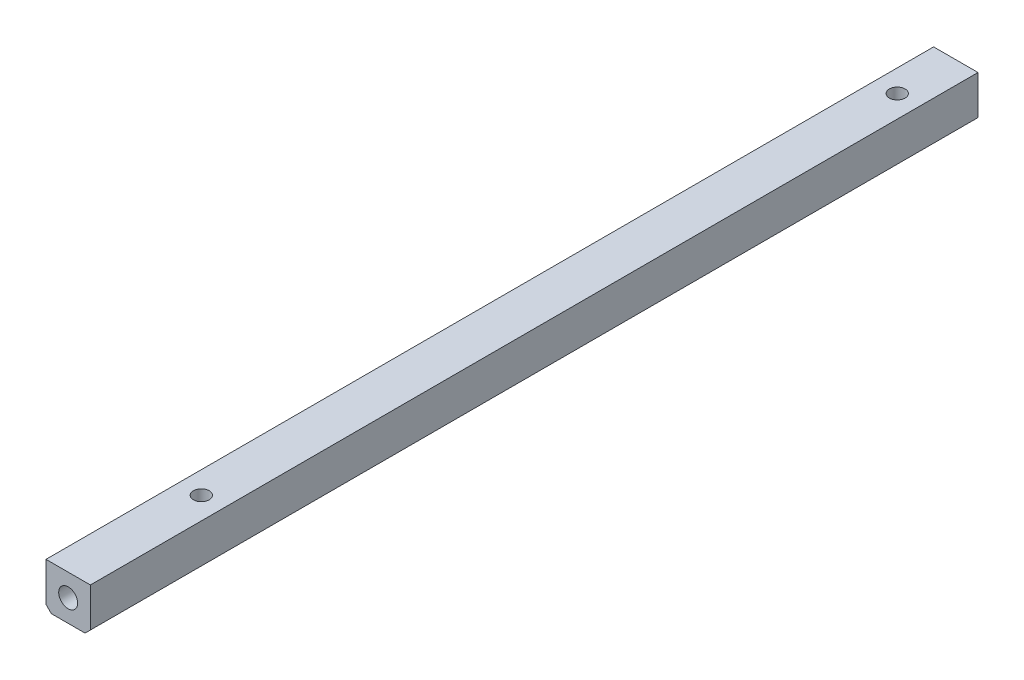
ISO-10303-21;
HEADER;
FILE_DESCRIPTION(('STEP AP214'),'2;1');
FILE_NAME('part.step','',(''),(''),'','','');
FILE_SCHEMA(('AUTOMOTIVE_DESIGN { 1 0 10303 214 1 1 1 1 }'));
ENDSEC;
DATA;
#1=APPLICATION_CONTEXT('core data for automotive mechanical design processes');
#2=APPLICATION_PROTOCOL_DEFINITION('international standard','automotive_design',2000,#1);
#3=PRODUCT_CONTEXT('',#1,'mechanical');
#4=PRODUCT('Part','Part','',(#3));
#5=PRODUCT_RELATED_PRODUCT_CATEGORY('part','',(#4));
#6=PRODUCT_DEFINITION_FORMATION('','',#4);
#7=PRODUCT_DEFINITION_CONTEXT('part definition',#1,'design');
#8=PRODUCT_DEFINITION('design','',#6,#7);
#9=PRODUCT_DEFINITION_SHAPE('','',#8);
#10=(LENGTH_UNIT() NAMED_UNIT(*) SI_UNIT(.MILLI.,.METRE.));
#11=(NAMED_UNIT(*) PLANE_ANGLE_UNIT() SI_UNIT($,.RADIAN.));
#12=(NAMED_UNIT(*) SI_UNIT($,.STERADIAN.) SOLID_ANGLE_UNIT());
#13=UNCERTAINTY_MEASURE_WITH_UNIT(LENGTH_MEASURE(1.E-05),#10,'distance_accuracy_value','');
#14=(GEOMETRIC_REPRESENTATION_CONTEXT(3) GLOBAL_UNCERTAINTY_ASSIGNED_CONTEXT((#13)) GLOBAL_UNIT_ASSIGNED_CONTEXT((#10,
#11,#12)) REPRESENTATION_CONTEXT('',''));
#15=CARTESIAN_POINT('',(0.,0.,0.));
#16=DIRECTION('',(0.,0.,1.));
#17=DIRECTION('',(1.,0.,0.));
#18=AXIS2_PLACEMENT_3D('',#15,#16,#17);
#19=CARTESIAN_POINT('',(3.17499999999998,0.,8.382));
#20=DIRECTION('',(0.,1.,0.));
#21=DIRECTION('',(-1.,0.,0.));
#22=AXIS2_PLACEMENT_3D('',#19,#20,#21);
#23=CYLINDRICAL_SURFACE('',#22,1.1303);
#24=CARTESIAN_POINT('',(3.17499999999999,6.35,8.382));
#25=DIRECTION('',(0.,1.,0.));
#26=DIRECTION('',(-1.,0.,0.));
#27=AXIS2_PLACEMENT_3D('',#24,#25,#26);
#28=CIRCLE('',#27,1.1303);
#29=CARTESIAN_POINT('',(2.04469999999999,6.35,8.382));
#30=VERTEX_POINT('',#29);
#31=EDGE_CURVE('E228',#30,#30,#28,.T.);
#32=ORIENTED_EDGE('',*,*,#31,.T.);
#33=EDGE_LOOP('',(#32));
#34=FACE_BOUND('',#33,.T.);
#35=CARTESIAN_POINT('',(3.17499999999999,3.175,8.382));
#36=DIRECTION('',(0.,0.707106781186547,0.707106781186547));
#37=DIRECTION('',(0.,0.707106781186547,-0.707106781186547));
#38=AXIS2_PLACEMENT_3D('',#35,#36,#37);
#39=ELLIPSE('',#38,1.59848558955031,1.1303);
#40=CARTESIAN_POINT('',(2.04469999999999,3.175,8.382));
#41=VERTEX_POINT('',#40);
#42=CARTESIAN_POINT('',(4.30529999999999,3.175,8.382));
#43=VERTEX_POINT('',#42);
#44=EDGE_CURVE('E100',#41,#43,#39,.F.);
#45=ORIENTED_EDGE('',*,*,#44,.T.);
#46=CARTESIAN_POINT('',(3.17499999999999,3.175,8.382));
#47=DIRECTION('',(0.,0.707106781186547,-0.707106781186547));
#48=DIRECTION('',(0.,0.707106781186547,0.707106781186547));
#49=AXIS2_PLACEMENT_3D('',#46,#47,#48);
#50=ELLIPSE('',#49,1.59848558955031,1.1303);
#51=EDGE_CURVE('E96',#43,#41,#50,.F.);
#52=ORIENTED_EDGE('',*,*,#51,.T.);
#53=EDGE_LOOP('',(#45,#52));
#54=FACE_BOUND('',#53,.T.);
#55=ADVANCED_FACE('F31',(#34,#54),#23,.F.);
#56=CARTESIAN_POINT('',(0.,0.,127.));
#57=DIRECTION('',(1.,0.,0.));
#58=DIRECTION('',(0.,0.,-1.));
#59=AXIS2_PLACEMENT_3D('',#56,#57,#58);
#60=PLANE('',#59);
#61=DIRECTION('',(0.,-1.,0.));
#62=VECTOR('',#61,1.);
#63=CARTESIAN_POINT('',(0.,0.,0.));
#64=LINE('',#63,#62);
#65=CARTESIAN_POINT('',(0.,6.35,0.));
#66=VERTEX_POINT('',#65);
#67=CARTESIAN_POINT('',(0.,0.761999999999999,0.));
#68=VERTEX_POINT('',#67);
#69=EDGE_CURVE('E150',#66,#68,#64,.T.);
#70=ORIENTED_EDGE('',*,*,#69,.T.);
#71=DIRECTION('',(0.,0.,1.));
#72=VECTOR('',#71,1.);
#73=CARTESIAN_POINT('',(0.,0.761999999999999,127.));
#74=LINE('',#73,#72);
#75=CARTESIAN_POINT('',(0.,0.761999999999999,127.));
#76=VERTEX_POINT('',#75);
#77=EDGE_CURVE('E11',#68,#76,#74,.T.);
#78=ORIENTED_EDGE('',*,*,#77,.T.);
#79=DIRECTION('',(0.,-1.,0.));
#80=VECTOR('',#79,1.);
#81=CARTESIAN_POINT('',(0.,0.,127.));
#82=LINE('',#81,#80);
#83=CARTESIAN_POINT('',(0.,6.35,127.));
#84=VERTEX_POINT('',#83);
#85=EDGE_CURVE('E159',#84,#76,#82,.T.);
#86=ORIENTED_EDGE('',*,*,#85,.F.);
#87=DIRECTION('',(0.,0.,-1.));
#88=VECTOR('',#87,1.);
#89=CARTESIAN_POINT('',(0.,6.35,127.));
#90=LINE('',#89,#88);
#91=EDGE_CURVE('E163',#84,#66,#90,.T.);
#92=ORIENTED_EDGE('',*,*,#91,.T.);
#93=EDGE_LOOP('',(#70,#78,#86,#92));
#94=FACE_BOUND('',#93,.T.);
#95=ADVANCED_FACE('F33',(#94),#60,.F.);
#96=CARTESIAN_POINT('',(0.,0.,127.));
#97=DIRECTION('',(0.,1.,0.));
#98=DIRECTION('',(0.,0.,1.));
#99=AXIS2_PLACEMENT_3D('',#96,#97,#98);
#100=PLANE('',#99);
#101=CARTESIAN_POINT('',(3.17499999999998,0.,8.382));
#102=DIRECTION('',(0.,1.,0.));
#103=DIRECTION('',(-1.,0.,0.));
#104=AXIS2_PLACEMENT_3D('',#101,#102,#103);
#105=CIRCLE('',#104,1.1303);
#106=CARTESIAN_POINT('',(2.04469999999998,0.,8.382));
#107=VERTEX_POINT('',#106);
#108=EDGE_CURVE('E221',#107,#107,#105,.T.);
#109=ORIENTED_EDGE('',*,*,#108,.T.);
#110=EDGE_LOOP('',(#109));
#111=FACE_BOUND('',#110,.T.);
#112=CARTESIAN_POINT('',(3.175,0.,107.95));
#113=DIRECTION('',(0.,1.,0.));
#114=DIRECTION('',(-1.,0.,0.));
#115=AXIS2_PLACEMENT_3D('',#112,#113,#114);
#116=CIRCLE('',#115,1.1303);
#117=CARTESIAN_POINT('',(2.0447,0.,107.95));
#118=VERTEX_POINT('',#117);
#119=EDGE_CURVE('E154',#118,#118,#116,.T.);
#120=ORIENTED_EDGE('',*,*,#119,.T.);
#121=EDGE_LOOP('',(#120));
#122=FACE_BOUND('',#121,.T.);
#123=DIRECTION('',(1.,0.,0.));
#124=VECTOR('',#123,1.);
#125=CARTESIAN_POINT('',(0.,0.,0.));
#126=LINE('',#125,#124);
#127=CARTESIAN_POINT('',(0.761999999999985,0.,0.));
#128=VERTEX_POINT('',#127);
#129=CARTESIAN_POINT('',(5.58799999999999,0.,0.));
#130=VERTEX_POINT('',#129);
#131=EDGE_CURVE('E145',#128,#130,#126,.T.);
#132=ORIENTED_EDGE('',*,*,#131,.T.);
#133=DIRECTION('',(0.,0.,1.));
#134=VECTOR('',#133,1.);
#135=CARTESIAN_POINT('',(5.58799999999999,0.,127.));
#136=LINE('',#135,#134);
#137=CARTESIAN_POINT('',(5.58799999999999,0.,127.));
#138=VERTEX_POINT('',#137);
#139=EDGE_CURVE('E52',#130,#138,#136,.T.);
#140=ORIENTED_EDGE('',*,*,#139,.T.);
#141=DIRECTION('',(1.,0.,0.));
#142=VECTOR('',#141,1.);
#143=CARTESIAN_POINT('',(0.,0.,127.));
#144=LINE('',#143,#142);
#145=CARTESIAN_POINT('',(0.761999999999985,0.,127.));
#146=VERTEX_POINT('',#145);
#147=EDGE_CURVE('E131',#146,#138,#144,.T.);
#148=ORIENTED_EDGE('',*,*,#147,.F.);
#149=DIRECTION('',(0.,0.,-1.));
#150=VECTOR('',#149,1.);
#151=CARTESIAN_POINT('',(0.761999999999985,0.,127.));
#152=LINE('',#151,#150);
#153=EDGE_CURVE('E120',#146,#128,#152,.T.);
#154=ORIENTED_EDGE('',*,*,#153,.T.);
#155=EDGE_LOOP('',(#132,#140,#148,#154));
#156=FACE_BOUND('',#155,.T.);
#157=ADVANCED_FACE('F148',(#111,#122,#156),#100,.F.);
#158=CARTESIAN_POINT('',(6.35,0.,127.));
#159=DIRECTION('',(-1.,0.,0.));
#160=DIRECTION('',(0.,0.,1.));
#161=AXIS2_PLACEMENT_3D('',#158,#159,#160);
#162=PLANE('',#161);
#163=DIRECTION('',(0.,1.,0.));
#164=VECTOR('',#163,1.);
#165=CARTESIAN_POINT('',(6.35,0.,127.));
#166=LINE('',#165,#164);
#167=CARTESIAN_POINT('',(6.35,0.762000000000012,127.));
#168=VERTEX_POINT('',#167);
#169=CARTESIAN_POINT('',(6.35,6.35,127.));
#170=VERTEX_POINT('',#169);
#171=EDGE_CURVE('E129',#168,#170,#166,.T.);
#172=ORIENTED_EDGE('',*,*,#171,.F.);
#173=DIRECTION('',(0.,0.,-1.));
#174=VECTOR('',#173,1.);
#175=CARTESIAN_POINT('',(6.35,0.762000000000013,127.));
#176=LINE('',#175,#174);
#177=CARTESIAN_POINT('',(6.35,0.762000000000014,0.));
#178=VERTEX_POINT('',#177);
#179=EDGE_CURVE('E108',#168,#178,#176,.T.);
#180=ORIENTED_EDGE('',*,*,#179,.T.);
#181=DIRECTION('',(0.,1.,0.));
#182=VECTOR('',#181,1.);
#183=CARTESIAN_POINT('',(6.35,0.,0.));
#184=LINE('',#183,#182);
#185=CARTESIAN_POINT('',(6.35,6.35,0.));
#186=VERTEX_POINT('',#185);
#187=EDGE_CURVE('E147',#178,#186,#184,.T.);
#188=ORIENTED_EDGE('',*,*,#187,.T.);
#189=DIRECTION('',(0.,0.,-1.));
#190=VECTOR('',#189,1.);
#191=CARTESIAN_POINT('',(6.35,6.35,127.));
#192=LINE('',#191,#190);
#193=EDGE_CURVE('E106',#170,#186,#192,.T.);
#194=ORIENTED_EDGE('',*,*,#193,.F.);
#195=EDGE_LOOP('',(#172,#180,#188,#194));
#196=FACE_BOUND('',#195,.T.);
#197=ADVANCED_FACE('F135',(#196),#162,.F.);
#198=CARTESIAN_POINT('',(0.,6.35,127.));
#199=DIRECTION('',(0.,-1.,0.));
#200=DIRECTION('',(1.,0.,0.));
#201=AXIS2_PLACEMENT_3D('',#198,#199,#200);
#202=PLANE('',#201);
#203=ORIENTED_EDGE('',*,*,#31,.F.);
#204=EDGE_LOOP('',(#203));
#205=FACE_BOUND('',#204,.T.);
#206=CARTESIAN_POINT('',(3.175,6.35,107.95));
#207=DIRECTION('',(0.,1.,0.));
#208=DIRECTION('',(-1.,0.,0.));
#209=AXIS2_PLACEMENT_3D('',#206,#207,#208);
#210=CIRCLE('',#209,1.1303);
#211=CARTESIAN_POINT('',(2.0447,6.35,107.95));
#212=VERTEX_POINT('',#211);
#213=EDGE_CURVE('E223',#212,#212,#210,.T.);
#214=ORIENTED_EDGE('',*,*,#213,.F.);
#215=EDGE_LOOP('',(#214));
#216=FACE_BOUND('',#215,.T.);
#217=DIRECTION('',(-1.,0.,0.));
#218=VECTOR('',#217,1.);
#219=CARTESIAN_POINT('',(0.,6.35,0.));
#220=LINE('',#219,#218);
#221=EDGE_CURVE('E152',#186,#66,#220,.T.);
#222=ORIENTED_EDGE('',*,*,#221,.T.);
#223=ORIENTED_EDGE('',*,*,#91,.F.);
#224=DIRECTION('',(-1.,0.,0.));
#225=VECTOR('',#224,1.);
#226=CARTESIAN_POINT('',(0.,6.35,127.));
#227=LINE('',#226,#225);
#228=EDGE_CURVE('E139',#170,#84,#227,.T.);
#229=ORIENTED_EDGE('',*,*,#228,.F.);
#230=ORIENTED_EDGE('',*,*,#193,.T.);
#231=EDGE_LOOP('',(#222,#223,#229,#230));
#232=FACE_BOUND('',#231,.T.);
#233=ADVANCED_FACE('F167',(#205,#216,#232),#202,.F.);
#234=CARTESIAN_POINT('',(0.,0.,127.));
#235=DIRECTION('',(0.,0.,-1.));
#236=DIRECTION('',(-1.,0.,0.));
#237=AXIS2_PLACEMENT_3D('',#234,#235,#236);
#238=PLANE('',#237);
#239=CARTESIAN_POINT('',(3.175,3.175,127.));
#240=DIRECTION('',(0.,0.,1.));
#241=DIRECTION('',(1.,0.,0.));
#242=AXIS2_PLACEMENT_3D('',#239,#240,#241);
#243=CIRCLE('',#242,1.3589);
#244=CARTESIAN_POINT('',(4.5339,3.175,127.));
#245=VERTEX_POINT('',#244);
#246=EDGE_CURVE('E233',#245,#245,#243,.T.);
#247=ORIENTED_EDGE('',*,*,#246,.F.);
#248=EDGE_LOOP('',(#247));
#249=FACE_BOUND('',#248,.T.);
#250=ORIENTED_EDGE('',*,*,#147,.T.);
#251=DIRECTION('',(-0.707106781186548,-0.707106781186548,0.));
#252=VECTOR('',#251,1.);
#253=CARTESIAN_POINT('',(6.35,0.762000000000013,127.));
#254=LINE('',#253,#252);
#255=EDGE_CURVE('E39',#138,#168,#254,.F.);
#256=ORIENTED_EDGE('',*,*,#255,.T.);
#257=ORIENTED_EDGE('',*,*,#171,.T.);
#258=ORIENTED_EDGE('',*,*,#228,.T.);
#259=ORIENTED_EDGE('',*,*,#85,.T.);
#260=DIRECTION('',(-0.707106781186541,0.707106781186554,0.));
#261=VECTOR('',#260,1.);
#262=CARTESIAN_POINT('',(0.761999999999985,0.,127.));
#263=LINE('',#262,#261);
#264=EDGE_CURVE('E124',#76,#146,#263,.F.);
#265=ORIENTED_EDGE('',*,*,#264,.T.);
#266=EDGE_LOOP('',(#250,#256,#257,#258,#259,#265));
#267=FACE_BOUND('',#266,.T.);
#268=ADVANCED_FACE('F128',(#249,#267),#238,.F.);
#269=CARTESIAN_POINT('',(0.,0.,0.));
#270=DIRECTION('',(0.,0.,-1.));
#271=DIRECTION('',(-1.,0.,0.));
#272=AXIS2_PLACEMENT_3D('',#269,#270,#271);
#273=PLANE('',#272);
#274=CARTESIAN_POINT('',(3.175,3.175,0.));
#275=DIRECTION('',(0.,0.,-1.));
#276=DIRECTION('',(-1.,0.,0.));
#277=AXIS2_PLACEMENT_3D('',#274,#275,#276);
#278=CIRCLE('',#277,1.1303);
#279=CARTESIAN_POINT('',(2.0447,3.175,0.));
#280=VERTEX_POINT('',#279);
#281=EDGE_CURVE('E239',#280,#280,#278,.T.);
#282=ORIENTED_EDGE('',*,*,#281,.F.);
#283=EDGE_LOOP('',(#282));
#284=FACE_BOUND('',#283,.T.);
#285=ORIENTED_EDGE('',*,*,#187,.F.);
#286=DIRECTION('',(0.707106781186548,0.707106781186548,0.));
#287=VECTOR('',#286,1.);
#288=CARTESIAN_POINT('',(2.79399999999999,-2.79399999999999,0.));
#289=LINE('',#288,#287);
#290=EDGE_CURVE('E118',#178,#130,#289,.F.);
#291=ORIENTED_EDGE('',*,*,#290,.T.);
#292=ORIENTED_EDGE('',*,*,#131,.F.);
#293=DIRECTION('',(0.707106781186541,-0.707106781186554,0.));
#294=VECTOR('',#293,1.);
#295=CARTESIAN_POINT('',(0.380999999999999,0.380999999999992,0.));
#296=LINE('',#295,#294);
#297=EDGE_CURVE('E116',#128,#68,#296,.F.);
#298=ORIENTED_EDGE('',*,*,#297,.T.);
#299=ORIENTED_EDGE('',*,*,#69,.F.);
#300=ORIENTED_EDGE('',*,*,#221,.F.);
#301=EDGE_LOOP('',(#285,#291,#292,#298,#299,#300));
#302=FACE_BOUND('',#301,.T.);
#303=ADVANCED_FACE('F144',(#284,#302),#273,.T.);
#304=CARTESIAN_POINT('',(3.175,0.,107.95));
#305=DIRECTION('',(0.,1.,0.));
#306=DIRECTION('',(-1.,0.,0.));
#307=AXIS2_PLACEMENT_3D('',#304,#305,#306);
#308=CYLINDRICAL_SURFACE('',#307,1.1303);
#309=ORIENTED_EDGE('',*,*,#119,.F.);
#310=EDGE_LOOP('',(#309));
#311=FACE_BOUND('',#310,.T.);
#312=ORIENTED_EDGE('',*,*,#213,.T.);
#313=EDGE_LOOP('',(#312));
#314=FACE_BOUND('',#313,.T.);
#315=ADVANCED_FACE('F191',(#311,#314),#308,.F.);
#316=CARTESIAN_POINT('',(3.17499999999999,3.175,8.382));
#317=DIRECTION('',(0.,0.707106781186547,0.707106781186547));
#318=DIRECTION('',(0.,0.707106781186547,-0.707106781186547));
#319=AXIS2_PLACEMENT_3D('',#316,#317,#318);
#320=ELLIPSE('',#319,1.59848558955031,1.1303);
#321=EDGE_CURVE('E92',#41,#43,#320,.T.);
#322=ORIENTED_EDGE('',*,*,#321,.T.);
#323=CARTESIAN_POINT('',(3.17499999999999,3.175,8.382));
#324=DIRECTION('',(0.,0.707106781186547,-0.707106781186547));
#325=DIRECTION('',(0.,0.707106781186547,0.707106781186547));
#326=AXIS2_PLACEMENT_3D('',#323,#324,#325);
#327=ELLIPSE('',#326,1.59848558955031,1.1303);
#328=EDGE_CURVE('E99',#43,#41,#327,.T.);
#329=ORIENTED_EDGE('',*,*,#328,.T.);
#330=EDGE_LOOP('',(#322,#329));
#331=FACE_BOUND('',#330,.T.);
#332=ORIENTED_EDGE('',*,*,#108,.F.);
#333=EDGE_LOOP('',(#332));
#334=FACE_BOUND('',#333,.T.);
#335=ADVANCED_FACE('F110',(#331,#334),#23,.F.);
#336=CARTESIAN_POINT('',(3.175,3.175,114.3));
#337=DIRECTION('',(0.,0.,1.));
#338=DIRECTION('',(1.,0.,0.));
#339=AXIS2_PLACEMENT_3D('',#336,#337,#338);
#340=CYLINDRICAL_SURFACE('',#339,1.3589);
#341=CARTESIAN_POINT('',(3.175,3.175,114.3));
#342=DIRECTION('',(0.,0.,1.));
#343=DIRECTION('',(1.,0.,0.));
#344=AXIS2_PLACEMENT_3D('',#341,#342,#343);
#345=CIRCLE('',#344,1.3589);
#346=CARTESIAN_POINT('',(4.5339,3.175,114.3));
#347=VERTEX_POINT('',#346);
#348=EDGE_CURVE('E230',#347,#347,#345,.T.);
#349=ORIENTED_EDGE('',*,*,#348,.F.);
#350=EDGE_LOOP('',(#349));
#351=FACE_BOUND('',#350,.T.);
#352=ORIENTED_EDGE('',*,*,#246,.T.);
#353=EDGE_LOOP('',(#352));
#354=FACE_BOUND('',#353,.T.);
#355=ADVANCED_FACE('F190',(#351,#354),#340,.F.);
#356=CARTESIAN_POINT('',(3.175,3.175,114.3));
#357=DIRECTION('',(0.,0.,1.));
#358=DIRECTION('',(1.,0.,0.));
#359=AXIS2_PLACEMENT_3D('',#356,#357,#358);
#360=PLANE('',#359);
#361=ORIENTED_EDGE('',*,*,#348,.T.);
#362=EDGE_LOOP('',(#361));
#363=FACE_BOUND('',#362,.T.);
#364=ADVANCED_FACE('F196',(#363),#360,.T.);
#365=CARTESIAN_POINT('',(3.175,3.175,10.16));
#366=DIRECTION('',(0.,0.,-1.));
#367=DIRECTION('',(-1.,0.,0.));
#368=AXIS2_PLACEMENT_3D('',#365,#366,#367);
#369=CYLINDRICAL_SURFACE('',#368,1.1303);
#370=ORIENTED_EDGE('',*,*,#281,.T.);
#371=EDGE_LOOP('',(#370));
#372=FACE_BOUND('',#371,.T.);
#373=ORIENTED_EDGE('',*,*,#44,.F.);
#374=ORIENTED_EDGE('',*,*,#328,.F.);
#375=EDGE_LOOP('',(#373,#374));
#376=FACE_BOUND('',#375,.T.);
#377=ADVANCED_FACE('F104',(#372,#376),#369,.F.);
#378=CARTESIAN_POINT('',(3.175,3.175,10.16));
#379=DIRECTION('',(0.,0.,-1.));
#380=DIRECTION('',(-1.,0.,0.));
#381=AXIS2_PLACEMENT_3D('',#378,#379,#380);
#382=CIRCLE('',#381,1.1303);
#383=CARTESIAN_POINT('',(2.0447,3.175,10.16));
#384=VERTEX_POINT('',#383);
#385=EDGE_CURVE('E236',#384,#384,#382,.T.);
#386=ORIENTED_EDGE('',*,*,#385,.F.);
#387=EDGE_LOOP('',(#386));
#388=FACE_BOUND('',#387,.T.);
#389=ORIENTED_EDGE('',*,*,#321,.F.);
#390=ORIENTED_EDGE('',*,*,#51,.F.);
#391=EDGE_LOOP('',(#389,#390));
#392=FACE_BOUND('',#391,.T.);
#393=ADVANCED_FACE('F94',(#388,#392),#369,.F.);
#394=CARTESIAN_POINT('',(3.175,3.175,10.16));
#395=DIRECTION('',(0.,0.,-1.));
#396=DIRECTION('',(-1.,0.,0.));
#397=AXIS2_PLACEMENT_3D('',#394,#395,#396);
#398=PLANE('',#397);
#399=ORIENTED_EDGE('',*,*,#385,.T.);
#400=EDGE_LOOP('',(#399));
#401=FACE_BOUND('',#400,.T.);
#402=ADVANCED_FACE('F178',(#401),#398,.T.);
#403=CARTESIAN_POINT('',(6.35,0.762000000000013,127.));
#404=DIRECTION('',(-0.707106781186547,0.707106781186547,0.));
#405=DIRECTION('',(-0.707106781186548,-0.707106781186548,0.));
#406=AXIS2_PLACEMENT_3D('',#403,#404,#405);
#407=PLANE('',#406);
#408=ORIENTED_EDGE('',*,*,#255,.F.);
#409=ORIENTED_EDGE('',*,*,#139,.F.);
#410=ORIENTED_EDGE('',*,*,#290,.F.);
#411=ORIENTED_EDGE('',*,*,#179,.F.);
#412=EDGE_LOOP('',(#408,#409,#410,#411));
#413=FACE_BOUND('',#412,.T.);
#414=ADVANCED_FACE('F141',(#413),#407,.F.);
#415=CARTESIAN_POINT('',(0.761999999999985,0.,127.));
#416=DIRECTION('',(0.707106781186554,0.707106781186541,0.));
#417=DIRECTION('',(-0.707106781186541,0.707106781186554,0.));
#418=AXIS2_PLACEMENT_3D('',#415,#416,#417);
#419=PLANE('',#418);
#420=ORIENTED_EDGE('',*,*,#264,.F.);
#421=ORIENTED_EDGE('',*,*,#77,.F.);
#422=ORIENTED_EDGE('',*,*,#297,.F.);
#423=ORIENTED_EDGE('',*,*,#153,.F.);
#424=EDGE_LOOP('',(#420,#421,#422,#423));
#425=FACE_BOUND('',#424,.T.);
#426=ADVANCED_FACE('F172',(#425),#419,.F.);
#427=CLOSED_SHELL('',(#55,#95,#157,#197,#233,#268,#303,#315,#335,#355,#364,#377,#393,#402,#414,#426));
#428=MANIFOLD_SOLID_BREP('B2',#427);
#429=ADVANCED_BREP_SHAPE_REPRESENTATION('',(#18,#428),#14);
#430=SHAPE_DEFINITION_REPRESENTATION(#9,#429);
ENDSEC;
END-ISO-10303-21;
